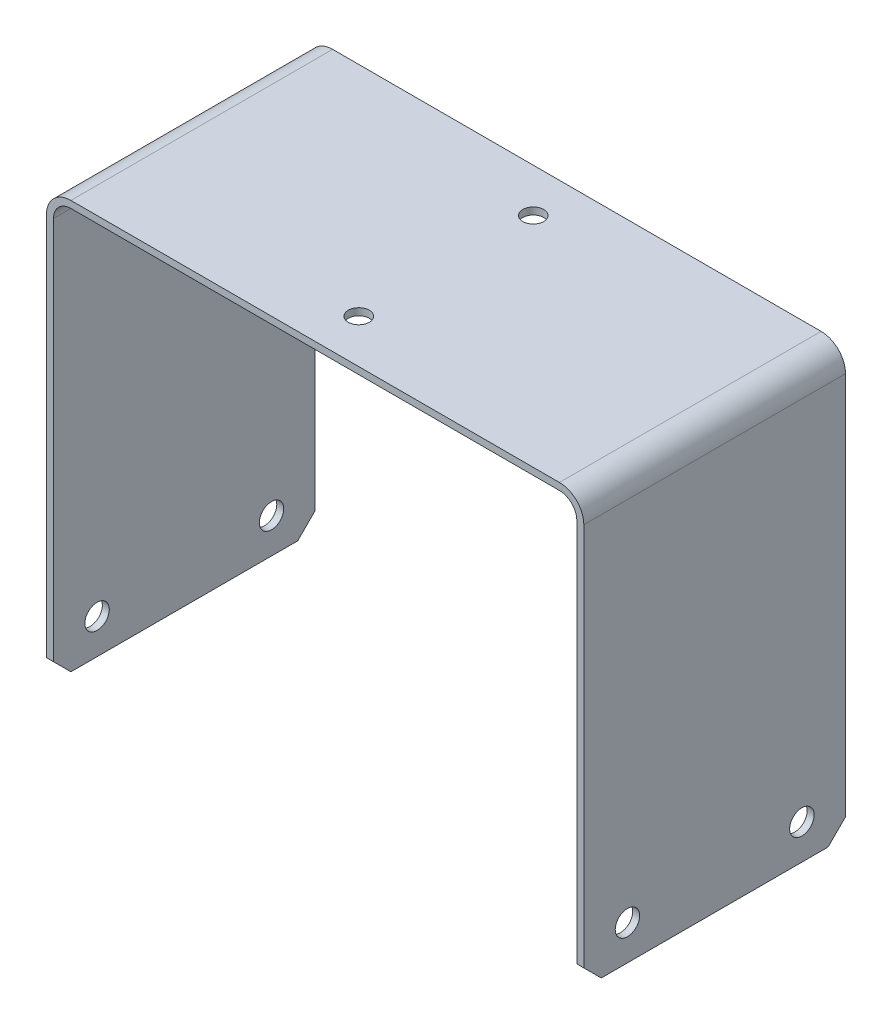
ISO-10303-21;
HEADER;
FILE_DESCRIPTION(('STEP AP214'),'2;1');
FILE_NAME('part.step','',(''),(''),'','','');
FILE_SCHEMA(('AUTOMOTIVE_DESIGN { 1 0 10303 214 1 1 1 1 }'));
ENDSEC;
DATA;
#1=APPLICATION_CONTEXT('core data for automotive mechanical design processes');
#2=APPLICATION_PROTOCOL_DEFINITION('international standard','automotive_design',2000,#1);
#3=PRODUCT_CONTEXT('',#1,'mechanical');
#4=PRODUCT('Part','Part','',(#3));
#5=PRODUCT_RELATED_PRODUCT_CATEGORY('part','',(#4));
#6=PRODUCT_DEFINITION_FORMATION('','',#4);
#7=PRODUCT_DEFINITION_CONTEXT('part definition',#1,'design');
#8=PRODUCT_DEFINITION('design','',#6,#7);
#9=PRODUCT_DEFINITION_SHAPE('','',#8);
#10=(LENGTH_UNIT() NAMED_UNIT(*) SI_UNIT(.MILLI.,.METRE.));
#11=(NAMED_UNIT(*) PLANE_ANGLE_UNIT() SI_UNIT($,.RADIAN.));
#12=(NAMED_UNIT(*) SI_UNIT($,.STERADIAN.) SOLID_ANGLE_UNIT());
#13=UNCERTAINTY_MEASURE_WITH_UNIT(LENGTH_MEASURE(1.E-05),#10,'distance_accuracy_value','');
#14=(GEOMETRIC_REPRESENTATION_CONTEXT(3) GLOBAL_UNCERTAINTY_ASSIGNED_CONTEXT((#13)) GLOBAL_UNIT_ASSIGNED_CONTEXT((#10,
#11,#12)) REPRESENTATION_CONTEXT('',''));
#15=CARTESIAN_POINT('',(0.,0.,0.));
#16=DIRECTION('',(0.,0.,1.));
#17=DIRECTION('',(1.,0.,0.));
#18=AXIS2_PLACEMENT_3D('',#15,#16,#17);
#19=CARTESIAN_POINT('',(75.,95.,37.5));
#20=DIRECTION('',(1.,0.,0.));
#21=DIRECTION('',(0.,1.,0.));
#22=AXIS2_PLACEMENT_3D('',#19,#20,#21);
#23=PLANE('',#22);
#24=CARTESIAN_POINT('',(75.,-10.,-25.));
#25=DIRECTION('',(1.,0.,0.));
#26=DIRECTION('',(0.,1.,0.));
#27=AXIS2_PLACEMENT_3D('',#24,#25,#26);
#28=CIRCLE('',#27,3.5);
#29=CARTESIAN_POINT('',(75.,-6.50000000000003,-25.));
#30=VERTEX_POINT('',#29);
#31=EDGE_CURVE('E290',#30,#30,#28,.T.);
#32=ORIENTED_EDGE('',*,*,#31,.T.);
#33=EDGE_LOOP('',(#32));
#34=FACE_BOUND('',#33,.T.);
#35=CARTESIAN_POINT('',(75.,-10.,25.));
#36=DIRECTION('',(1.,0.,0.));
#37=DIRECTION('',(0.,1.,0.));
#38=AXIS2_PLACEMENT_3D('',#35,#36,#37);
#39=CIRCLE('',#38,3.5);
#40=CARTESIAN_POINT('',(75.,-6.50000000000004,25.));
#41=VERTEX_POINT('',#40);
#42=EDGE_CURVE('E278',#41,#41,#39,.T.);
#43=ORIENTED_EDGE('',*,*,#42,.T.);
#44=EDGE_LOOP('',(#43));
#45=FACE_BOUND('',#44,.T.);
#46=DIRECTION('',(0.,-1.,0.));
#47=VECTOR('',#46,1.);
#48=CARTESIAN_POINT('',(75.,95.,-37.5));
#49=LINE('',#48,#47);
#50=CARTESIAN_POINT('',(75.,95.,-37.5));
#51=VERTEX_POINT('',#50);
#52=CARTESIAN_POINT('',(75.,-15.,-37.5));
#53=VERTEX_POINT('',#52);
#54=EDGE_CURVE('E169',#51,#53,#49,.T.);
#55=ORIENTED_EDGE('',*,*,#54,.T.);
#56=DIRECTION('',(0.,-0.707106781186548,0.707106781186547));
#57=VECTOR('',#56,1.);
#58=CARTESIAN_POINT('',(75.,-15.,-37.5));
#59=LINE('',#58,#57);
#60=CARTESIAN_POINT('',(75.,-20.,-32.5));
#61=VERTEX_POINT('',#60);
#62=EDGE_CURVE('E254',#53,#61,#59,.T.);
#63=ORIENTED_EDGE('',*,*,#62,.T.);
#64=DIRECTION('',(0.,0.,-1.));
#65=VECTOR('',#64,1.);
#66=CARTESIAN_POINT('',(75.,-20.,37.5));
#67=LINE('',#66,#65);
#68=CARTESIAN_POINT('',(75.,-20.,32.5));
#69=VERTEX_POINT('',#68);
#70=EDGE_CURVE('E236',#69,#61,#67,.T.);
#71=ORIENTED_EDGE('',*,*,#70,.F.);
#72=DIRECTION('',(0.,-0.70710678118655,-0.707106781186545));
#73=VECTOR('',#72,1.);
#74=CARTESIAN_POINT('',(75.,-20.,32.5));
#75=LINE('',#74,#73);
#76=CARTESIAN_POINT('',(75.,-15.,37.5));
#77=VERTEX_POINT('',#76);
#78=EDGE_CURVE('E252',#69,#77,#75,.F.);
#79=ORIENTED_EDGE('',*,*,#78,.T.);
#80=DIRECTION('',(0.,-1.,0.));
#81=VECTOR('',#80,1.);
#82=CARTESIAN_POINT('',(75.,95.,37.5));
#83=LINE('',#82,#81);
#84=CARTESIAN_POINT('',(75.,95.,37.5));
#85=VERTEX_POINT('',#84);
#86=EDGE_CURVE('E191',#85,#77,#83,.T.);
#87=ORIENTED_EDGE('',*,*,#86,.F.);
#88=DIRECTION('',(0.,0.,-1.));
#89=VECTOR('',#88,1.);
#90=CARTESIAN_POINT('',(75.,95.,37.5));
#91=LINE('',#90,#89);
#92=EDGE_CURVE('E213',#85,#51,#91,.T.);
#93=ORIENTED_EDGE('',*,*,#92,.T.);
#94=EDGE_LOOP('',(#55,#63,#71,#79,#87,#93));
#95=FACE_BOUND('',#94,.T.);
#96=ADVANCED_FACE('F32',(#34,#45,#95),#23,.F.);
#97=CARTESIAN_POINT('',(77.,-20.,37.5));
#98=DIRECTION('',(0.,-1.,0.));
#99=DIRECTION('',(1.,0.,0.));
#100=AXIS2_PLACEMENT_3D('',#97,#98,#99);
#101=PLANE('',#100);
#102=ORIENTED_EDGE('',*,*,#70,.T.);
#103=DIRECTION('',(1.,0.,0.));
#104=VECTOR('',#103,1.);
#105=CARTESIAN_POINT('',(77.,-20.,-32.5));
#106=LINE('',#105,#104);
#107=CARTESIAN_POINT('',(77.,-20.,-32.5));
#108=VERTEX_POINT('',#107);
#109=EDGE_CURVE('E259',#61,#108,#106,.T.);
#110=ORIENTED_EDGE('',*,*,#109,.T.);
#111=DIRECTION('',(0.,0.,-1.));
#112=VECTOR('',#111,1.);
#113=CARTESIAN_POINT('',(77.,-20.,37.5));
#114=LINE('',#113,#112);
#115=CARTESIAN_POINT('',(77.,-20.,32.5));
#116=VERTEX_POINT('',#115);
#117=EDGE_CURVE('E157',#116,#108,#114,.T.);
#118=ORIENTED_EDGE('',*,*,#117,.F.);
#119=DIRECTION('',(-1.,0.,0.));
#120=VECTOR('',#119,1.);
#121=CARTESIAN_POINT('',(77.,-20.,32.5));
#122=LINE('',#121,#120);
#123=EDGE_CURVE('E256',#116,#69,#122,.T.);
#124=ORIENTED_EDGE('',*,*,#123,.T.);
#125=EDGE_LOOP('',(#102,#110,#118,#124));
#126=FACE_BOUND('',#125,.T.);
#127=ADVANCED_FACE('F310',(#126),#101,.T.);
#128=CARTESIAN_POINT('',(77.,95.,37.5));
#129=DIRECTION('',(1.,0.,0.));
#130=DIRECTION('',(0.,1.,0.));
#131=AXIS2_PLACEMENT_3D('',#128,#129,#130);
#132=PLANE('',#131);
#133=CARTESIAN_POINT('',(77.,-10.,-25.));
#134=DIRECTION('',(-1.,0.,0.));
#135=DIRECTION('',(0.,-1.,0.));
#136=AXIS2_PLACEMENT_3D('',#133,#134,#135);
#137=CIRCLE('',#136,3.5);
#138=CARTESIAN_POINT('',(77.,-13.5,-25.));
#139=VERTEX_POINT('',#138);
#140=EDGE_CURVE('E495',#139,#139,#137,.T.);
#141=ORIENTED_EDGE('',*,*,#140,.T.);
#142=EDGE_LOOP('',(#141));
#143=FACE_BOUND('',#142,.T.);
#144=CARTESIAN_POINT('',(77.,-10.,25.));
#145=DIRECTION('',(-1.,0.,0.));
#146=DIRECTION('',(0.,-1.,0.));
#147=AXIS2_PLACEMENT_3D('',#144,#145,#146);
#148=CIRCLE('',#147,3.5);
#149=CARTESIAN_POINT('',(77.,-13.5,25.));
#150=VERTEX_POINT('',#149);
#151=EDGE_CURVE('E279',#150,#150,#148,.T.);
#152=ORIENTED_EDGE('',*,*,#151,.T.);
#153=EDGE_LOOP('',(#152));
#154=FACE_BOUND('',#153,.T.);
#155=ORIENTED_EDGE('',*,*,#117,.T.);
#156=DIRECTION('',(0.,0.707106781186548,-0.707106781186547));
#157=VECTOR('',#156,1.);
#158=CARTESIAN_POINT('',(77.,2.5,-55.));
#159=LINE('',#158,#157);
#160=CARTESIAN_POINT('',(77.,-15.,-37.5));
#161=VERTEX_POINT('',#160);
#162=EDGE_CURVE('E165',#108,#161,#159,.T.);
#163=ORIENTED_EDGE('',*,*,#162,.T.);
#164=DIRECTION('',(0.,-1.,0.));
#165=VECTOR('',#164,1.);
#166=CARTESIAN_POINT('',(77.,95.,-37.5));
#167=LINE('',#166,#165);
#168=CARTESIAN_POINT('',(77.,95.,-37.5));
#169=VERTEX_POINT('',#168);
#170=EDGE_CURVE('E161',#169,#161,#167,.T.);
#171=ORIENTED_EDGE('',*,*,#170,.F.);
#172=DIRECTION('',(0.,0.,-1.));
#173=VECTOR('',#172,1.);
#174=CARTESIAN_POINT('',(77.,95.,37.5));
#175=LINE('',#174,#173);
#176=CARTESIAN_POINT('',(77.,95.,37.5));
#177=VERTEX_POINT('',#176);
#178=EDGE_CURVE('E146',#177,#169,#175,.T.);
#179=ORIENTED_EDGE('',*,*,#178,.F.);
#180=DIRECTION('',(0.,-1.,0.));
#181=VECTOR('',#180,1.);
#182=CARTESIAN_POINT('',(77.,95.,37.5));
#183=LINE('',#182,#181);
#184=CARTESIAN_POINT('',(77.,-15.,37.5));
#185=VERTEX_POINT('',#184);
#186=EDGE_CURVE('E194',#177,#185,#183,.T.);
#187=ORIENTED_EDGE('',*,*,#186,.T.);
#188=DIRECTION('',(0.,0.70710678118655,0.707106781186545));
#189=VECTOR('',#188,1.);
#190=CARTESIAN_POINT('',(77.,40.0000000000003,92.5));
#191=LINE('',#190,#189);
#192=EDGE_CURVE('E261',#185,#116,#191,.F.);
#193=ORIENTED_EDGE('',*,*,#192,.T.);
#194=EDGE_LOOP('',(#155,#163,#171,#179,#187,#193));
#195=FACE_BOUND('',#194,.T.);
#196=ADVANCED_FACE('F163',(#143,#154,#195),#132,.T.);
#197=CARTESIAN_POINT('',(70.,95.,37.5));
#198=DIRECTION('',(0.,0.,-1.));
#199=DIRECTION('',(-1.,0.,0.));
#200=AXIS2_PLACEMENT_3D('',#197,#198,#199);
#201=CYLINDRICAL_SURFACE('',#200,7.);
#202=CARTESIAN_POINT('',(70.,95.,-37.5));
#203=DIRECTION('',(0.,0.,1.));
#204=DIRECTION('',(1.,0.,0.));
#205=AXIS2_PLACEMENT_3D('',#202,#203,#204);
#206=CIRCLE('',#205,7.);
#207=CARTESIAN_POINT('',(70.,102.,-37.5));
#208=VERTEX_POINT('',#207);
#209=EDGE_CURVE('E150',#208,#169,#206,.F.);
#210=ORIENTED_EDGE('',*,*,#209,.F.);
#211=DIRECTION('',(0.,0.,-1.));
#212=VECTOR('',#211,1.);
#213=CARTESIAN_POINT('',(70.,102.,37.5));
#214=LINE('',#213,#212);
#215=CARTESIAN_POINT('',(70.,102.,37.5));
#216=VERTEX_POINT('',#215);
#217=EDGE_CURVE('E158',#216,#208,#214,.T.);
#218=ORIENTED_EDGE('',*,*,#217,.F.);
#219=CARTESIAN_POINT('',(70.,95.,37.5));
#220=DIRECTION('',(0.,0.,1.));
#221=DIRECTION('',(1.,0.,0.));
#222=AXIS2_PLACEMENT_3D('',#219,#220,#221);
#223=CIRCLE('',#222,7.);
#224=EDGE_CURVE('E153',#216,#177,#223,.F.);
#225=ORIENTED_EDGE('',*,*,#224,.T.);
#226=ORIENTED_EDGE('',*,*,#178,.T.);
#227=EDGE_LOOP('',(#210,#218,#225,#226));
#228=FACE_BOUND('',#227,.T.);
#229=ADVANCED_FACE('F148',(#228),#201,.T.);
#230=CARTESIAN_POINT('',(-70.,102.,37.5));
#231=DIRECTION('',(0.,1.,0.));
#232=DIRECTION('',(-1.,0.,0.));
#233=AXIS2_PLACEMENT_3D('',#230,#231,#232);
#234=PLANE('',#233);
#235=CARTESIAN_POINT('',(0.,102.,-25.));
#236=DIRECTION('',(0.,1.,0.));
#237=DIRECTION('',(0.,0.,1.));
#238=AXIS2_PLACEMENT_3D('',#235,#236,#237);
#239=CIRCLE('',#238,3.);
#240=CARTESIAN_POINT('',(0.,102.,-22.));
#241=VERTEX_POINT('',#240);
#242=EDGE_CURVE('E247',#241,#241,#239,.T.);
#243=ORIENTED_EDGE('',*,*,#242,.F.);
#244=EDGE_LOOP('',(#243));
#245=FACE_BOUND('',#244,.T.);
#246=CARTESIAN_POINT('',(0.,102.,25.));
#247=DIRECTION('',(0.,1.,0.));
#248=DIRECTION('',(0.,0.,1.));
#249=AXIS2_PLACEMENT_3D('',#246,#247,#248);
#250=CIRCLE('',#249,3.);
#251=CARTESIAN_POINT('',(0.,102.,28.));
#252=VERTEX_POINT('',#251);
#253=EDGE_CURVE('E243',#252,#252,#250,.T.);
#254=ORIENTED_EDGE('',*,*,#253,.F.);
#255=EDGE_LOOP('',(#254));
#256=FACE_BOUND('',#255,.T.);
#257=DIRECTION('',(1.,0.,0.));
#258=VECTOR('',#257,1.);
#259=CARTESIAN_POINT('',(-70.,102.,-37.5));
#260=LINE('',#259,#258);
#261=CARTESIAN_POINT('',(-70.,102.,-37.5));
#262=VERTEX_POINT('',#261);
#263=EDGE_CURVE('E174',#262,#208,#260,.T.);
#264=ORIENTED_EDGE('',*,*,#263,.F.);
#265=DIRECTION('',(0.,0.,-1.));
#266=VECTOR('',#265,1.);
#267=CARTESIAN_POINT('',(-70.,102.,37.5));
#268=LINE('',#267,#266);
#269=CARTESIAN_POINT('',(-70.,102.,37.5));
#270=VERTEX_POINT('',#269);
#271=EDGE_CURVE('E232',#270,#262,#268,.T.);
#272=ORIENTED_EDGE('',*,*,#271,.F.);
#273=DIRECTION('',(1.,0.,0.));
#274=VECTOR('',#273,1.);
#275=CARTESIAN_POINT('',(-70.,102.,37.5));
#276=LINE('',#275,#274);
#277=EDGE_CURVE('E197',#270,#216,#276,.T.);
#278=ORIENTED_EDGE('',*,*,#277,.T.);
#279=ORIENTED_EDGE('',*,*,#217,.T.);
#280=EDGE_LOOP('',(#264,#272,#278,#279));
#281=FACE_BOUND('',#280,.T.);
#282=ADVANCED_FACE('F349',(#245,#256,#281),#234,.T.);
#283=CARTESIAN_POINT('',(-70.,95.,37.5));
#284=DIRECTION('',(0.,0.,-1.));
#285=DIRECTION('',(-1.,0.,0.));
#286=AXIS2_PLACEMENT_3D('',#283,#284,#285);
#287=CYLINDRICAL_SURFACE('',#286,7.);
#288=CARTESIAN_POINT('',(-70.,95.,-37.5));
#289=DIRECTION('',(0.,0.,1.));
#290=DIRECTION('',(1.,0.,0.));
#291=AXIS2_PLACEMENT_3D('',#288,#289,#290);
#292=CIRCLE('',#291,7.);
#293=CARTESIAN_POINT('',(-77.,95.,-37.5));
#294=VERTEX_POINT('',#293);
#295=EDGE_CURVE('E176',#294,#262,#292,.F.);
#296=ORIENTED_EDGE('',*,*,#295,.F.);
#297=DIRECTION('',(0.,0.,-1.));
#298=VECTOR('',#297,1.);
#299=CARTESIAN_POINT('',(-77.,95.,37.5));
#300=LINE('',#299,#298);
#301=CARTESIAN_POINT('',(-77.,95.,37.5));
#302=VERTEX_POINT('',#301);
#303=EDGE_CURVE('E229',#302,#294,#300,.T.);
#304=ORIENTED_EDGE('',*,*,#303,.F.);
#305=CARTESIAN_POINT('',(-70.,95.,37.5));
#306=DIRECTION('',(0.,0.,1.));
#307=DIRECTION('',(1.,0.,0.));
#308=AXIS2_PLACEMENT_3D('',#305,#306,#307);
#309=CIRCLE('',#308,7.);
#310=EDGE_CURVE('E200',#302,#270,#309,.F.);
#311=ORIENTED_EDGE('',*,*,#310,.T.);
#312=ORIENTED_EDGE('',*,*,#271,.T.);
#313=EDGE_LOOP('',(#296,#304,#311,#312));
#314=FACE_BOUND('',#313,.T.);
#315=ADVANCED_FACE('F346',(#314),#287,.T.);
#316=CARTESIAN_POINT('',(-77.,-20.,37.5));
#317=DIRECTION('',(-1.,0.,0.));
#318=DIRECTION('',(0.,-1.,0.));
#319=AXIS2_PLACEMENT_3D('',#316,#317,#318);
#320=PLANE('',#319);
#321=CARTESIAN_POINT('',(-77.,-10.,-25.));
#322=DIRECTION('',(-1.,0.,0.));
#323=DIRECTION('',(0.,-1.,0.));
#324=AXIS2_PLACEMENT_3D('',#321,#322,#323);
#325=CIRCLE('',#324,3.5);
#326=CARTESIAN_POINT('',(-77.,-13.5,-25.));
#327=VERTEX_POINT('',#326);
#328=EDGE_CURVE('E499',#327,#327,#325,.T.);
#329=ORIENTED_EDGE('',*,*,#328,.F.);
#330=EDGE_LOOP('',(#329));
#331=FACE_BOUND('',#330,.T.);
#332=CARTESIAN_POINT('',(-77.,-10.,25.));
#333=DIRECTION('',(-1.,0.,0.));
#334=DIRECTION('',(0.,-1.,0.));
#335=AXIS2_PLACEMENT_3D('',#332,#333,#334);
#336=CIRCLE('',#335,3.5);
#337=CARTESIAN_POINT('',(-77.,-13.5,25.));
#338=VERTEX_POINT('',#337);
#339=EDGE_CURVE('E285',#338,#338,#336,.T.);
#340=ORIENTED_EDGE('',*,*,#339,.F.);
#341=EDGE_LOOP('',(#340));
#342=FACE_BOUND('',#341,.T.);
#343=DIRECTION('',(0.,1.,0.));
#344=VECTOR('',#343,1.);
#345=CARTESIAN_POINT('',(-77.,-20.,-37.5));
#346=LINE('',#345,#344);
#347=CARTESIAN_POINT('',(-77.,-15.,-37.5));
#348=VERTEX_POINT('',#347);
#349=EDGE_CURVE('E181',#348,#294,#346,.T.);
#350=ORIENTED_EDGE('',*,*,#349,.F.);
#351=DIRECTION('',(0.,-0.707106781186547,0.707106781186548));
#352=VECTOR('',#351,1.);
#353=CARTESIAN_POINT('',(-77.,-55.,2.50000000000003));
#354=LINE('',#353,#352);
#355=CARTESIAN_POINT('',(-77.,-20.,-32.5));
#356=VERTEX_POINT('',#355);
#357=EDGE_CURVE('E270',#348,#356,#354,.T.);
#358=ORIENTED_EDGE('',*,*,#357,.T.);
#359=DIRECTION('',(0.,0.,-1.));
#360=VECTOR('',#359,1.);
#361=CARTESIAN_POINT('',(-77.,-20.,37.5));
#362=LINE('',#361,#360);
#363=CARTESIAN_POINT('',(-77.,-20.,32.5));
#364=VERTEX_POINT('',#363);
#365=EDGE_CURVE('E227',#364,#356,#362,.T.);
#366=ORIENTED_EDGE('',*,*,#365,.F.);
#367=DIRECTION('',(0.,-0.707106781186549,-0.707106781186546));
#368=VECTOR('',#367,1.);
#369=CARTESIAN_POINT('',(-77.,-17.5,35.));
#370=LINE('',#369,#368);
#371=CARTESIAN_POINT('',(-77.,-15.,37.5));
#372=VERTEX_POINT('',#371);
#373=EDGE_CURVE('E268',#364,#372,#370,.F.);
#374=ORIENTED_EDGE('',*,*,#373,.T.);
#375=DIRECTION('',(0.,1.,0.));
#376=VECTOR('',#375,1.);
#377=CARTESIAN_POINT('',(-77.,-20.,37.5));
#378=LINE('',#377,#376);
#379=EDGE_CURVE('E203',#372,#302,#378,.T.);
#380=ORIENTED_EDGE('',*,*,#379,.T.);
#381=ORIENTED_EDGE('',*,*,#303,.T.);
#382=EDGE_LOOP('',(#350,#358,#366,#374,#380,#381));
#383=FACE_BOUND('',#382,.T.);
#384=ADVANCED_FACE('F339',(#331,#342,#383),#320,.T.);
#385=CARTESIAN_POINT('',(-75.,-20.,37.5));
#386=DIRECTION('',(0.,-1.,0.));
#387=DIRECTION('',(0.,0.,-1.));
#388=AXIS2_PLACEMENT_3D('',#385,#386,#387);
#389=PLANE('',#388);
#390=ORIENTED_EDGE('',*,*,#365,.T.);
#391=DIRECTION('',(1.,0.,0.));
#392=VECTOR('',#391,1.);
#393=CARTESIAN_POINT('',(-75.,-20.,-32.5));
#394=LINE('',#393,#392);
#395=CARTESIAN_POINT('',(-75.,-20.,-32.5));
#396=VERTEX_POINT('',#395);
#397=EDGE_CURVE('E48',#356,#396,#394,.T.);
#398=ORIENTED_EDGE('',*,*,#397,.T.);
#399=DIRECTION('',(0.,0.,-1.));
#400=VECTOR('',#399,1.);
#401=CARTESIAN_POINT('',(-75.,-20.,37.5));
#402=LINE('',#401,#400);
#403=CARTESIAN_POINT('',(-75.,-20.,32.5));
#404=VERTEX_POINT('',#403);
#405=EDGE_CURVE('E225',#404,#396,#402,.T.);
#406=ORIENTED_EDGE('',*,*,#405,.F.);
#407=DIRECTION('',(-1.,0.,0.));
#408=VECTOR('',#407,1.);
#409=CARTESIAN_POINT('',(-75.,-20.,32.5));
#410=LINE('',#409,#408);
#411=EDGE_CURVE('E272',#404,#364,#410,.T.);
#412=ORIENTED_EDGE('',*,*,#411,.T.);
#413=EDGE_LOOP('',(#390,#398,#406,#412));
#414=FACE_BOUND('',#413,.T.);
#415=ADVANCED_FACE('F354',(#414),#389,.T.);
#416=CARTESIAN_POINT('',(-75.,-20.,37.5));
#417=DIRECTION('',(-1.,0.,0.));
#418=DIRECTION('',(0.,-1.,0.));
#419=AXIS2_PLACEMENT_3D('',#416,#417,#418);
#420=PLANE('',#419);
#421=CARTESIAN_POINT('',(-75.,-10.,-25.));
#422=DIRECTION('',(-1.,0.,0.));
#423=DIRECTION('',(0.,-1.,0.));
#424=AXIS2_PLACEMENT_3D('',#421,#422,#423);
#425=CIRCLE('',#424,3.5);
#426=CARTESIAN_POINT('',(-75.,-13.5,-25.));
#427=VERTEX_POINT('',#426);
#428=EDGE_CURVE('E35',#427,#427,#425,.T.);
#429=ORIENTED_EDGE('',*,*,#428,.T.);
#430=EDGE_LOOP('',(#429));
#431=FACE_BOUND('',#430,.T.);
#432=CARTESIAN_POINT('',(-75.,-10.,25.));
#433=DIRECTION('',(-1.,0.,0.));
#434=DIRECTION('',(0.,-1.,0.));
#435=AXIS2_PLACEMENT_3D('',#432,#433,#434);
#436=CIRCLE('',#435,3.5);
#437=CARTESIAN_POINT('',(-75.,-13.5,25.));
#438=VERTEX_POINT('',#437);
#439=EDGE_CURVE('E276',#438,#438,#436,.T.);
#440=ORIENTED_EDGE('',*,*,#439,.T.);
#441=EDGE_LOOP('',(#440));
#442=FACE_BOUND('',#441,.T.);
#443=ORIENTED_EDGE('',*,*,#405,.T.);
#444=DIRECTION('',(0.,0.707106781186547,-0.707106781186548));
#445=VECTOR('',#444,1.);
#446=CARTESIAN_POINT('',(-75.,-15.,-37.5));
#447=LINE('',#446,#445);
#448=CARTESIAN_POINT('',(-75.,-15.,-37.5));
#449=VERTEX_POINT('',#448);
#450=EDGE_CURVE('E11',#396,#449,#447,.T.);
#451=ORIENTED_EDGE('',*,*,#450,.T.);
#452=DIRECTION('',(0.,1.,0.));
#453=VECTOR('',#452,1.);
#454=CARTESIAN_POINT('',(-75.,-20.,-37.5));
#455=LINE('',#454,#453);
#456=CARTESIAN_POINT('',(-75.,95.,-37.5));
#457=VERTEX_POINT('',#456);
#458=EDGE_CURVE('E183',#449,#457,#455,.T.);
#459=ORIENTED_EDGE('',*,*,#458,.T.);
#460=DIRECTION('',(0.,0.,-1.));
#461=VECTOR('',#460,1.);
#462=CARTESIAN_POINT('',(-75.,95.,37.5));
#463=LINE('',#462,#461);
#464=CARTESIAN_POINT('',(-75.,95.,37.5));
#465=VERTEX_POINT('',#464);
#466=EDGE_CURVE('E222',#465,#457,#463,.T.);
#467=ORIENTED_EDGE('',*,*,#466,.F.);
#468=DIRECTION('',(0.,1.,0.));
#469=VECTOR('',#468,1.);
#470=CARTESIAN_POINT('',(-75.,-20.,37.5));
#471=LINE('',#470,#469);
#472=CARTESIAN_POINT('',(-75.,-15.,37.5));
#473=VERTEX_POINT('',#472);
#474=EDGE_CURVE('E205',#473,#465,#471,.T.);
#475=ORIENTED_EDGE('',*,*,#474,.F.);
#476=DIRECTION('',(0.,0.707106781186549,0.707106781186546));
#477=VECTOR('',#476,1.);
#478=CARTESIAN_POINT('',(-75.,-20.,32.5));
#479=LINE('',#478,#477);
#480=EDGE_CURVE('E40',#473,#404,#479,.F.);
#481=ORIENTED_EDGE('',*,*,#480,.T.);
#482=EDGE_LOOP('',(#443,#451,#459,#467,#475,#481));
#483=FACE_BOUND('',#482,.T.);
#484=ADVANCED_FACE('F333',(#431,#442,#483),#420,.F.);
#485=CARTESIAN_POINT('',(-70.,95.,37.5));
#486=DIRECTION('',(0.,0.,-1.));
#487=DIRECTION('',(-1.,0.,0.));
#488=AXIS2_PLACEMENT_3D('',#485,#486,#487);
#489=CYLINDRICAL_SURFACE('',#488,5.);
#490=CARTESIAN_POINT('',(-70.,95.,-37.5));
#491=DIRECTION('',(0.,0.,-1.));
#492=DIRECTION('',(-1.,0.,0.));
#493=AXIS2_PLACEMENT_3D('',#490,#491,#492);
#494=CIRCLE('',#493,5.);
#495=CARTESIAN_POINT('',(-70.,100.,-37.5));
#496=VERTEX_POINT('',#495);
#497=EDGE_CURVE('E185',#457,#496,#494,.T.);
#498=ORIENTED_EDGE('',*,*,#497,.T.);
#499=DIRECTION('',(0.,0.,-1.));
#500=VECTOR('',#499,1.);
#501=CARTESIAN_POINT('',(-70.,100.,37.5));
#502=LINE('',#501,#500);
#503=CARTESIAN_POINT('',(-70.,100.,37.5));
#504=VERTEX_POINT('',#503);
#505=EDGE_CURVE('E219',#504,#496,#502,.T.);
#506=ORIENTED_EDGE('',*,*,#505,.F.);
#507=CARTESIAN_POINT('',(-70.,95.,37.5));
#508=DIRECTION('',(0.,0.,-1.));
#509=DIRECTION('',(-1.,0.,0.));
#510=AXIS2_PLACEMENT_3D('',#507,#508,#509);
#511=CIRCLE('',#510,5.);
#512=EDGE_CURVE('E207',#465,#504,#511,.T.);
#513=ORIENTED_EDGE('',*,*,#512,.F.);
#514=ORIENTED_EDGE('',*,*,#466,.T.);
#515=EDGE_LOOP('',(#498,#506,#513,#514));
#516=FACE_BOUND('',#515,.T.);
#517=ADVANCED_FACE('F330',(#516),#489,.F.);
#518=CARTESIAN_POINT('',(-70.,100.,37.5));
#519=DIRECTION('',(0.,1.,0.));
#520=DIRECTION('',(-1.,0.,0.));
#521=AXIS2_PLACEMENT_3D('',#518,#519,#520);
#522=PLANE('',#521);
#523=CARTESIAN_POINT('',(0.,100.,-25.));
#524=DIRECTION('',(0.,1.,0.));
#525=DIRECTION('',(-1.,0.,0.));
#526=AXIS2_PLACEMENT_3D('',#523,#524,#525);
#527=CIRCLE('',#526,3.);
#528=CARTESIAN_POINT('',(-3.00000000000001,100.,-25.));
#529=VERTEX_POINT('',#528);
#530=EDGE_CURVE('E244',#529,#529,#527,.T.);
#531=ORIENTED_EDGE('',*,*,#530,.T.);
#532=EDGE_LOOP('',(#531));
#533=FACE_BOUND('',#532,.T.);
#534=CARTESIAN_POINT('',(0.,100.,25.));
#535=DIRECTION('',(0.,1.,0.));
#536=DIRECTION('',(-1.,0.,0.));
#537=AXIS2_PLACEMENT_3D('',#534,#535,#536);
#538=CIRCLE('',#537,3.);
#539=CARTESIAN_POINT('',(-3.00000000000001,100.,25.));
#540=VERTEX_POINT('',#539);
#541=EDGE_CURVE('E240',#540,#540,#538,.T.);
#542=ORIENTED_EDGE('',*,*,#541,.T.);
#543=EDGE_LOOP('',(#542));
#544=FACE_BOUND('',#543,.T.);
#545=DIRECTION('',(1.,0.,0.));
#546=VECTOR('',#545,1.);
#547=CARTESIAN_POINT('',(-70.,100.,-37.5));
#548=LINE('',#547,#546);
#549=CARTESIAN_POINT('',(70.,100.,-37.5));
#550=VERTEX_POINT('',#549);
#551=EDGE_CURVE('E187',#496,#550,#548,.T.);
#552=ORIENTED_EDGE('',*,*,#551,.T.);
#553=DIRECTION('',(0.,0.,-1.));
#554=VECTOR('',#553,1.);
#555=CARTESIAN_POINT('',(70.,100.,37.5));
#556=LINE('',#555,#554);
#557=CARTESIAN_POINT('',(70.,100.,37.5));
#558=VERTEX_POINT('',#557);
#559=EDGE_CURVE('E216',#558,#550,#556,.T.);
#560=ORIENTED_EDGE('',*,*,#559,.F.);
#561=DIRECTION('',(1.,0.,0.));
#562=VECTOR('',#561,1.);
#563=CARTESIAN_POINT('',(-70.,100.,37.5));
#564=LINE('',#563,#562);
#565=EDGE_CURVE('E209',#504,#558,#564,.T.);
#566=ORIENTED_EDGE('',*,*,#565,.F.);
#567=ORIENTED_EDGE('',*,*,#505,.T.);
#568=EDGE_LOOP('',(#552,#560,#566,#567));
#569=FACE_BOUND('',#568,.T.);
#570=ADVANCED_FACE('F324',(#533,#544,#569),#522,.F.);
#571=CARTESIAN_POINT('',(70.,95.,37.5));
#572=DIRECTION('',(0.,0.,-1.));
#573=DIRECTION('',(-1.,0.,0.));
#574=AXIS2_PLACEMENT_3D('',#571,#572,#573);
#575=CYLINDRICAL_SURFACE('',#574,5.);
#576=CARTESIAN_POINT('',(70.,95.,-37.5));
#577=DIRECTION('',(0.,0.,-1.));
#578=DIRECTION('',(1.,0.,0.));
#579=AXIS2_PLACEMENT_3D('',#576,#577,#578);
#580=CIRCLE('',#579,5.);
#581=EDGE_CURVE('E189',#550,#51,#580,.T.);
#582=ORIENTED_EDGE('',*,*,#581,.T.);
#583=ORIENTED_EDGE('',*,*,#92,.F.);
#584=CARTESIAN_POINT('',(70.,95.,37.5));
#585=DIRECTION('',(0.,0.,-1.));
#586=DIRECTION('',(1.,0.,0.));
#587=AXIS2_PLACEMENT_3D('',#584,#585,#586);
#588=CIRCLE('',#587,5.);
#589=EDGE_CURVE('E211',#558,#85,#588,.T.);
#590=ORIENTED_EDGE('',*,*,#589,.F.);
#591=ORIENTED_EDGE('',*,*,#559,.T.);
#592=EDGE_LOOP('',(#582,#583,#590,#591));
#593=FACE_BOUND('',#592,.T.);
#594=ADVANCED_FACE('F322',(#593),#575,.F.);
#595=CARTESIAN_POINT('',(70.,95.,37.5));
#596=DIRECTION('',(0.,0.,1.));
#597=DIRECTION('',(1.,0.,0.));
#598=AXIS2_PLACEMENT_3D('',#595,#596,#597);
#599=PLANE('',#598);
#600=ORIENTED_EDGE('',*,*,#86,.T.);
#601=DIRECTION('',(1.,0.,0.));
#602=VECTOR('',#601,1.);
#603=CARTESIAN_POINT('',(69.9999999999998,-15.,37.5));
#604=LINE('',#603,#602);
#605=EDGE_CURVE('E266',#77,#185,#604,.T.);
#606=ORIENTED_EDGE('',*,*,#605,.T.);
#607=ORIENTED_EDGE('',*,*,#186,.F.);
#608=ORIENTED_EDGE('',*,*,#224,.F.);
#609=ORIENTED_EDGE('',*,*,#277,.F.);
#610=ORIENTED_EDGE('',*,*,#310,.F.);
#611=ORIENTED_EDGE('',*,*,#379,.F.);
#612=DIRECTION('',(1.,0.,0.));
#613=VECTOR('',#612,1.);
#614=CARTESIAN_POINT('',(70.,-15.,37.5));
#615=LINE('',#614,#613);
#616=EDGE_CURVE('E264',#372,#473,#615,.T.);
#617=ORIENTED_EDGE('',*,*,#616,.T.);
#618=ORIENTED_EDGE('',*,*,#474,.T.);
#619=ORIENTED_EDGE('',*,*,#512,.T.);
#620=ORIENTED_EDGE('',*,*,#565,.T.);
#621=ORIENTED_EDGE('',*,*,#589,.T.);
#622=EDGE_LOOP('',(#600,#606,#607,#608,#609,#610,#611,#617,#618,#619,#620,#621));
#623=FACE_BOUND('',#622,.T.);
#624=ADVANCED_FACE('F317',(#623),#599,.T.);
#625=CARTESIAN_POINT('',(70.,95.,-37.5));
#626=DIRECTION('',(0.,0.,1.));
#627=DIRECTION('',(1.,0.,0.));
#628=AXIS2_PLACEMENT_3D('',#625,#626,#627);
#629=PLANE('',#628);
#630=ORIENTED_EDGE('',*,*,#170,.T.);
#631=DIRECTION('',(-1.,0.,0.));
#632=VECTOR('',#631,1.);
#633=CARTESIAN_POINT('',(75.,-15.,-37.5));
#634=LINE('',#633,#632);
#635=EDGE_CURVE('E250',#161,#53,#634,.T.);
#636=ORIENTED_EDGE('',*,*,#635,.T.);
#637=ORIENTED_EDGE('',*,*,#54,.F.);
#638=ORIENTED_EDGE('',*,*,#581,.F.);
#639=ORIENTED_EDGE('',*,*,#551,.F.);
#640=ORIENTED_EDGE('',*,*,#497,.F.);
#641=ORIENTED_EDGE('',*,*,#458,.F.);
#642=DIRECTION('',(-1.,0.,0.));
#643=VECTOR('',#642,1.);
#644=CARTESIAN_POINT('',(-77.,-15.,-37.5));
#645=LINE('',#644,#643);
#646=EDGE_CURVE('E239',#449,#348,#645,.T.);
#647=ORIENTED_EDGE('',*,*,#646,.T.);
#648=ORIENTED_EDGE('',*,*,#349,.T.);
#649=ORIENTED_EDGE('',*,*,#295,.T.);
#650=ORIENTED_EDGE('',*,*,#263,.T.);
#651=ORIENTED_EDGE('',*,*,#209,.T.);
#652=EDGE_LOOP('',(#630,#636,#637,#638,#639,#640,#641,#647,#648,#649,#650,#651));
#653=FACE_BOUND('',#652,.T.);
#654=ADVANCED_FACE('F171',(#653),#629,.F.);
#655=CARTESIAN_POINT('',(0.,27.,25.));
#656=DIRECTION('',(0.,1.,0.));
#657=DIRECTION('',(0.,0.,1.));
#658=AXIS2_PLACEMENT_3D('',#655,#656,#657);
#659=CYLINDRICAL_SURFACE('',#658,3.);
#660=ORIENTED_EDGE('',*,*,#253,.T.);
#661=EDGE_LOOP('',(#660));
#662=FACE_BOUND('',#661,.T.);
#663=ORIENTED_EDGE('',*,*,#541,.F.);
#664=EDGE_LOOP('',(#663));
#665=FACE_BOUND('',#664,.T.);
#666=ADVANCED_FACE('F401',(#662,#665),#659,.F.);
#667=CARTESIAN_POINT('',(0.,27.,-25.));
#668=DIRECTION('',(0.,1.,0.));
#669=DIRECTION('',(0.,0.,1.));
#670=AXIS2_PLACEMENT_3D('',#667,#668,#669);
#671=CYLINDRICAL_SURFACE('',#670,3.);
#672=ORIENTED_EDGE('',*,*,#242,.T.);
#673=EDGE_LOOP('',(#672));
#674=FACE_BOUND('',#673,.T.);
#675=ORIENTED_EDGE('',*,*,#530,.F.);
#676=EDGE_LOOP('',(#675));
#677=FACE_BOUND('',#676,.T.);
#678=ADVANCED_FACE('F398',(#674,#677),#671,.F.);
#679=CARTESIAN_POINT('',(69.9999999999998,-15.,-37.5));
#680=DIRECTION('',(0.,-0.707106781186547,-0.707106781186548));
#681=DIRECTION('',(0.,0.707106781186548,-0.707106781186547));
#682=AXIS2_PLACEMENT_3D('',#679,#680,#681);
#683=PLANE('',#682);
#684=ORIENTED_EDGE('',*,*,#162,.F.);
#685=ORIENTED_EDGE('',*,*,#109,.F.);
#686=ORIENTED_EDGE('',*,*,#62,.F.);
#687=ORIENTED_EDGE('',*,*,#635,.F.);
#688=EDGE_LOOP('',(#684,#685,#686,#687));
#689=FACE_BOUND('',#688,.T.);
#690=ADVANCED_FACE('F306',(#689),#683,.T.);
#691=CARTESIAN_POINT('',(77.,-20.,32.5));
#692=DIRECTION('',(0.,0.707106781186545,-0.707106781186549));
#693=DIRECTION('',(0.,0.70710678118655,0.707106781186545));
#694=AXIS2_PLACEMENT_3D('',#691,#692,#693);
#695=PLANE('',#694);
#696=ORIENTED_EDGE('',*,*,#192,.F.);
#697=ORIENTED_EDGE('',*,*,#605,.F.);
#698=ORIENTED_EDGE('',*,*,#78,.F.);
#699=ORIENTED_EDGE('',*,*,#123,.F.);
#700=EDGE_LOOP('',(#696,#697,#698,#699));
#701=FACE_BOUND('',#700,.T.);
#702=ADVANCED_FACE('F315',(#701),#695,.F.);
#703=CARTESIAN_POINT('',(70.,-15.,-37.5));
#704=DIRECTION('',(0.,-0.707106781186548,-0.707106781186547));
#705=DIRECTION('',(0.,0.707106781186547,-0.707106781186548));
#706=AXIS2_PLACEMENT_3D('',#703,#704,#705);
#707=PLANE('',#706);
#708=ORIENTED_EDGE('',*,*,#450,.F.);
#709=ORIENTED_EDGE('',*,*,#397,.F.);
#710=ORIENTED_EDGE('',*,*,#357,.F.);
#711=ORIENTED_EDGE('',*,*,#646,.F.);
#712=EDGE_LOOP('',(#708,#709,#710,#711));
#713=FACE_BOUND('',#712,.T.);
#714=ADVANCED_FACE('F336',(#713),#707,.T.);
#715=CARTESIAN_POINT('',(-75.,-20.,32.5));
#716=DIRECTION('',(0.,0.707106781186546,-0.707106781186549));
#717=DIRECTION('',(0.,0.707106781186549,0.707106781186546));
#718=AXIS2_PLACEMENT_3D('',#715,#716,#717);
#719=PLANE('',#718);
#720=ORIENTED_EDGE('',*,*,#480,.F.);
#721=ORIENTED_EDGE('',*,*,#616,.F.);
#722=ORIENTED_EDGE('',*,*,#373,.F.);
#723=ORIENTED_EDGE('',*,*,#411,.F.);
#724=EDGE_LOOP('',(#720,#721,#722,#723));
#725=FACE_BOUND('',#724,.T.);
#726=ADVANCED_FACE('F352',(#725),#719,.F.);
#727=CARTESIAN_POINT('',(77.,-10.,25.));
#728=DIRECTION('',(-1.,0.,0.));
#729=DIRECTION('',(0.,-1.,0.));
#730=AXIS2_PLACEMENT_3D('',#727,#728,#729);
#731=CYLINDRICAL_SURFACE('',#730,3.5);
#732=ORIENTED_EDGE('',*,*,#339,.T.);
#733=EDGE_LOOP('',(#732));
#734=FACE_BOUND('',#733,.T.);
#735=ORIENTED_EDGE('',*,*,#439,.F.);
#736=EDGE_LOOP('',(#735));
#737=FACE_BOUND('',#736,.T.);
#738=ADVANCED_FACE('F378',(#734,#737),#731,.F.);
#739=ORIENTED_EDGE('',*,*,#151,.F.);
#740=EDGE_LOOP('',(#739));
#741=FACE_BOUND('',#740,.T.);
#742=ORIENTED_EDGE('',*,*,#42,.F.);
#743=EDGE_LOOP('',(#742));
#744=FACE_BOUND('',#743,.T.);
#745=ADVANCED_FACE('F375',(#741,#744),#731,.F.);
#746=CARTESIAN_POINT('',(77.,-10.,-25.));
#747=DIRECTION('',(-1.,0.,0.));
#748=DIRECTION('',(0.,-1.,0.));
#749=AXIS2_PLACEMENT_3D('',#746,#747,#748);
#750=CYLINDRICAL_SURFACE('',#749,3.5);
#751=ORIENTED_EDGE('',*,*,#328,.T.);
#752=EDGE_LOOP('',(#751));
#753=FACE_BOUND('',#752,.T.);
#754=ORIENTED_EDGE('',*,*,#428,.F.);
#755=EDGE_LOOP('',(#754));
#756=FACE_BOUND('',#755,.T.);
#757=ADVANCED_FACE('F377',(#753,#756),#750,.F.);
#758=ORIENTED_EDGE('',*,*,#140,.F.);
#759=EDGE_LOOP('',(#758));
#760=FACE_BOUND('',#759,.T.);
#761=ORIENTED_EDGE('',*,*,#31,.F.);
#762=EDGE_LOOP('',(#761));
#763=FACE_BOUND('',#762,.T.);
#764=ADVANCED_FACE('F385',(#760,#763),#750,.F.);
#765=CLOSED_SHELL('',(#96,#127,#196,#229,#282,#315,#384,#415,#484,#517,#570,#594,#624,#654,#666,
#678,#690,#702,#714,#726,#738,#745,#757,#764));
#766=MANIFOLD_SOLID_BREP('B2',#765);
#767=ADVANCED_BREP_SHAPE_REPRESENTATION('',(#18,#766),#14);
#768=SHAPE_DEFINITION_REPRESENTATION(#9,#767);
ENDSEC;
END-ISO-10303-21;
